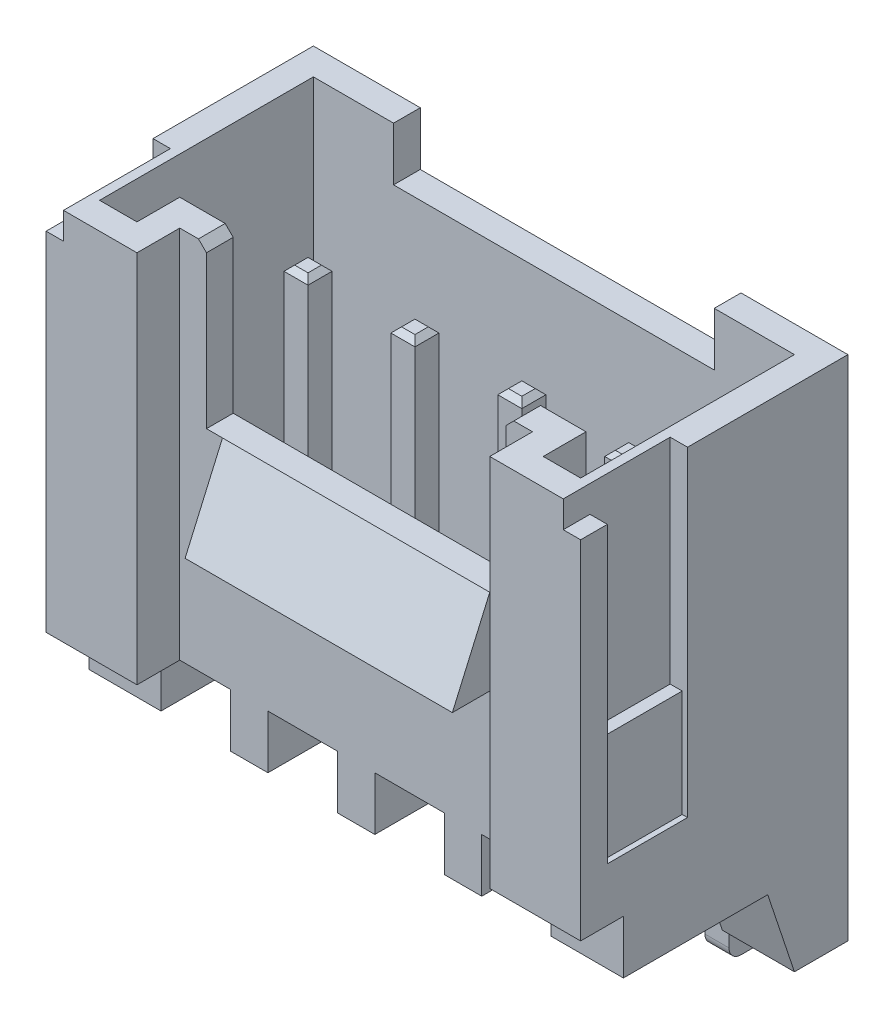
from build123d import *

# Parameters (mm, degrees)
ESQUISSE1_W                = 10
ESQUISSE1_H                = 5
BOSS_EXTRU_1_DEPTH         = 8
ESQUISSE7_W                = 0.8
ESQUISSE7_H                = 1
ENL_V_MAT_EXTRU_5_DEPTH    = 14.747727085
ENL_V_MAT_EXTRU_6_DEPTH    = 0.65
R_P_TITION_LIN_AIRE3_COUNT = 4
R_P_TITION_LIN_AIRE3_PITCH = 2
ESQUISSE2_W                = 6.6
ESQUISSE2_H                = 1.6
ENL_V_MAT_EXTRU_1_DEPTH    = 11.677078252
ENL_V_MAT_EXTRU_2_DEPTH    = 6.5
ESQUISSE5_W                = 6
ESQUISSE5_H                = 1
ENL_V_MAT_EXTRU_3_DEPTH    = 1
ESQUISSE6_W                = 5.6
ESQUISSE6_H                = 1
ENL_V_MAT_EXTRU_4_DEPTH    = 3
BOSS_EXTRU_2_DEPTH         = 2.5
CHANFREIN1_SIZE            = 0.15
EXTRU_MINCE2_DEPTH         = 0.225
R_P_TITION_LIN_AIRE4_COUNT = 4
R_P_TITION_LIN_AIRE4_PITCH = 2
BOSS_EXTRU_4_DEPTH         = 1.35
CHANFREIN2_SIZE            = 0.1
CONG_1_R                   = 0.225
CONG_2_R                   = 0.225
CONG_3_R                   = 0.225
CONG_4_R                   = 0.225
ESQUISSE19_W               = 1.5
ESQUISSE19_H               = 6.440145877
ENL_V_MAT_EXTRU_7_DEPTH    = 0.1
ENL_V_MAT_EXTRU_8_DEPTH    = 0.225
CHANFREIN3_SIZE            = 0.1
CHANFREIN4_SIZE            = 0.1
CHANFREIN5_SIZE            = 0.1


with BuildPart() as part:
    # Esquisse1 → Boss.-Extru.1 (new body)
    with BuildSketch(Plane(origin=(0, 0, 0), x_dir=(1, 0, 0), z_dir=(0, 1, 0))):
        with Locations((0, 2.5)):
            Rectangle(ESQUISSE1_W, ESQUISSE1_H)
    extrude(amount=BOSS_EXTRU_1_DEPTH)

    # Esquisse7 → Enl_v. mat.-Extru.5 (cut, through all)
    with BuildSketch(Plane(origin=(5, 0, 0), x_dir=(0, 0, -1), z_dir=(1, 0, 0))):
        with Locations((0.4, 0.5)):
            Rectangle(ESQUISSE7_W, ESQUISSE7_H)
    extrude(amount=-ENL_V_MAT_EXTRU_5_DEPTH, mode=Mode.SUBTRACT)

    # Esquisse8 → Enl_v. mat.-Extru.6 (cut, symmetric)
    with BuildSketch(Plane(origin=(3, 0, 0), x_dir=(0, 0, -1), z_dir=(1, 0, 0))):
        Polygon((0.8, 1), (1.1, 1), (1.9, 0.2), (3.9, 0.2), (4.7, 1), (5, 1), (5, 0), (0.8, 0), align=None)
    enl_v_mat_extru_6 = extrude(amount=ENL_V_MAT_EXTRU_6_DEPTH, both=True, mode=Mode.SUBTRACT)

    # R_p_tition lin_aire3: Enl_v. mat.-Extru.6 ×4
    with Locations(*[(-i * R_P_TITION_LIN_AIRE3_PITCH, 0, 0) for i in range(1, R_P_TITION_LIN_AIRE3_COUNT)]):
        add(enl_v_mat_extru_6, mode=Mode.SUBTRACT)

    # Esquisse2 → Enl_v. mat.-Extru.1 (cut, through all)
    with BuildSketch(Plane(origin=(0, 8, 0), x_dir=(1, 0, 0), z_dir=(0, 1, 0))):
        Rectangle(ESQUISSE2_W, ESQUISSE2_H)
    extrude(amount=-ENL_V_MAT_EXTRU_1_DEPTH, mode=Mode.SUBTRACT)

    # Esquisse4 → Enl_v. mat.-Extru.2 (cut)
    with BuildSketch(Plane(origin=(0, 8, 0), x_dir=(1, 0, 0), z_dir=(0, 1, 0))):
        Polygon((-3.8, 1.3), (3.8, 1.3), (3.8, 0.5), (4.5, 0.5), (4.5, 4.5), (-4.5, 4.5), (-4.5, 0.5), (-3.8, 0.5), align=None)
    extrude(amount=-ENL_V_MAT_EXTRU_2_DEPTH, mode=Mode.SUBTRACT)

    # Esquisse5 → Enl_v. mat.-Extru.3 (cut)
    with BuildSketch(Plane(origin=(0, 8, 0), x_dir=(1, 0, 0), z_dir=(0, 1, 0))):
        with Locations((0, 4.5)):
            Rectangle(ESQUISSE5_W, ESQUISSE5_H)
    extrude(amount=-ENL_V_MAT_EXTRU_3_DEPTH, mode=Mode.SUBTRACT)

    # Esquisse6 → Enl_v. mat.-Extru.4 (cut)
    with BuildSketch(Plane(origin=(0, 8, 0), x_dir=(1, 0, 0), z_dir=(0, 1, 0))):
        with Locations((0, 0.8)):
            Rectangle(ESQUISSE6_W, ESQUISSE6_H)
    extrude(amount=-ENL_V_MAT_EXTRU_4_DEPTH, mode=Mode.SUBTRACT)

    # Esquisse11 → Boss.-Extru.2 (add, symmetric)
    with BuildSketch(Plane(origin=(0, 0, 0), x_dir=(0, 0, -1), z_dir=(1, 0, 0))):
        Polygon((0.8, 5), (0.1, 3.4), (0.8, 3.4), align=None)
    extrude(amount=BOSS_EXTRU_2_DEPTH, both=True)

    # Chanfrein1
    chanfrein1_edges = [part.edges().sort_by_distance(p)[0] for p in [
        (2.8, 8, -1.05),
        (-2.8, 8, -1.05),
    ]]
    chamfer(chanfrein1_edges, length=CHANFREIN1_SIZE)

    # Esquisse18 → Boss.-Extru.4 (add)
    with BuildSketch(Plane.ZY.offset(5)):
        Polygon((-5, 0), (-5, -1.5), (-4, -1.5), (-3.5, 0), align=None)
    boss_extru_4 = extrude(amount=-BOSS_EXTRU_4_DEPTH)

    # Esquisse19 → Enl_v. mat.-Extru.7 (cut)
    with BuildSketch(Plane.ZY.offset(5)):
        with Locations((-1.25, 5.220072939)):
            Rectangle(ESQUISSE19_W, ESQUISSE19_H)
    enl_v_mat_extru_7 = extrude(amount=-ENL_V_MAT_EXTRU_7_DEPTH, mode=Mode.SUBTRACT)

    # Esquisse20 → Enl_v. mat.-Extru.8 (cut, symmetric)
    with BuildSketch(Plane.ZY.offset(4.9)):
        Polygon((-2, 4), (-0.5, 4), (-0.5, 7.5), (0.56066855, 7.5), (0.56066855, 8.388803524), (-2, 8.388803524), align=None)
    enl_v_mat_extru_8 = extrude(amount=ENL_V_MAT_EXTRU_8_DEPTH, both=True, mode=Mode.SUBTRACT)

    # Sym_trie5: Enl_v. mat.-Extru.7 across plane
    add(enl_v_mat_extru_7.mirror(Plane(origin=(0, 0, 0), x_dir=(0, 0, 1), z_dir=(1, 0, 0))), mode=Mode.SUBTRACT)

    # Sym_trie6: Enl_v. mat.-Extru.8 across plane
    add(enl_v_mat_extru_8.mirror(Plane(origin=(0, 0, 0), x_dir=(0, 0, 1), z_dir=(1, 0, 0))), mode=Mode.SUBTRACT)

    # Sym_trie8: Boss.-Extru.4 across plane
    add(boss_extru_4.mirror(Plane(origin=(0, 0, 0), x_dir=(0, 0, 1), z_dir=(1, 0, 0))))


with BuildPart() as body_2:
    # Esquisse16 → Extru.-Mince2 (new, symmetric)
    with BuildSketch(Plane.ZY.offset(-3)):
        with BuildLine():
            Line((-3.125, 6.5), (-3.125, -0.02713738))
            Line((-3.125, -0.02713738), (-4.665948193, -0.438056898))
            ThreePointArc((-4.665948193, -0.438056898), (-4.906844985, -0.598706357), (-5, -0.87286262))
            Line((-5, -0.87286262), (-5, -2.5))
            Line((-5, -2.5), (-4.55, -2.5))
            Line((-4.55, -2.5), (-4.55, -0.87286262))
            Line((-4.55, -0.87286262), (-3.009051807, -0.461943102))
            ThreePointArc((-3.009051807, -0.461943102), (-2.768155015, -0.301293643), (-2.675, -0.02713738))
            Line((-2.675, -0.02713738), (-2.675, 6.5))
            Line((-2.675, 6.5), (-3.125, 6.5))
        make_face()
    extrude(amount=EXTRU_MINCE2_DEPTH, both=True)


with BuildPart() as r_p_tition_lin_aire4_1:
    # R_p_tition lin_aire4: pattern copy
    add(body_2.part.moved(Location(Vector(-1, 0, 0) * (1 * R_P_TITION_LIN_AIRE4_PITCH))))

    # Cong_3
    cong_3_edges = [r_p_tition_lin_aire4_1.edges().sort_by_distance(p)[0] for p in [
        (1, -2.5, -4.55),
    ]]
    fillet(cong_3_edges, radius=CONG_3_R)

    # Chanfrein5
    chanfrein5_edges = [r_p_tition_lin_aire4_1.edges().sort_by_distance(p)[0] for p in [
        (1, 6.5, -3.125),
        (1, 6.5, -2.675),
        (0.775, 6.5, -2.9),
        (1.225, 6.5, -2.9),
    ]]
    chamfer(chanfrein5_edges, length=CHANFREIN5_SIZE)


with BuildPart() as r_p_tition_lin_aire4_2:
    # R_p_tition lin_aire4: pattern copy
    add(body_2.part.moved(Location(Vector(-1, 0, 0) * (2 * R_P_TITION_LIN_AIRE4_PITCH))))

    # Cong_2
    cong_2_edges = [r_p_tition_lin_aire4_2.edges().sort_by_distance(p)[0] for p in [
        (-1, -2.5, -4.55),
    ]]
    fillet(cong_2_edges, radius=CONG_2_R)

    # Chanfrein4
    chanfrein4_edges = [r_p_tition_lin_aire4_2.edges().sort_by_distance(p)[0] for p in [
        (-1, 6.5, -3.125),
        (-1, 6.5, -2.675),
        (-1.225, 6.5, -2.9),
        (-0.775, 6.5, -2.9),
    ]]
    chamfer(chanfrein4_edges, length=CHANFREIN4_SIZE)


with BuildPart() as r_p_tition_lin_aire4_3:
    # R_p_tition lin_aire4: pattern copy
    add(body_2.part.moved(Location(Vector(-1, 0, 0) * (3 * R_P_TITION_LIN_AIRE4_PITCH))))

    # Cong_1
    cong_1_edges = [r_p_tition_lin_aire4_3.edges().sort_by_distance(p)[0] for p in [
        (-3, -2.5, -4.55),
    ]]
    fillet(cong_1_edges, radius=CONG_1_R)

    # Chanfrein3
    chanfrein3_edges = [r_p_tition_lin_aire4_3.edges().sort_by_distance(p)[0] for p in [
        (-3, 6.5, -3.125),
        (-3, 6.5, -2.675),
        (-3.225, 6.5, -2.9),
        (-2.775, 6.5, -2.9),
    ]]
    chamfer(chanfrein3_edges, length=CHANFREIN3_SIZE)


with BuildPart() as body_2_1:
    add(body_2.part)

    # Chanfrein2
    chanfrein2_edges = [body_2_1.edges().sort_by_distance(p)[0] for p in [
        (3, 6.5, -3.125),
        (3, 6.5, -2.675),
        (2.775, 6.5, -2.9),
        (3.225, 6.5, -2.9),
    ]]
    chamfer(chanfrein2_edges, length=CHANFREIN2_SIZE)

    # Cong_4
    cong_4_edges = [body_2_1.edges().sort_by_distance(p)[0] for p in [
        (3, -2.5, -4.55),
    ]]
    fillet(cong_4_edges, radius=CONG_4_R)


solid = Compound([part.part, r_p_tition_lin_aire4_1.part, r_p_tition_lin_aire4_2.part, r_p_tition_lin_aire4_3.part, body_2_1.part])
